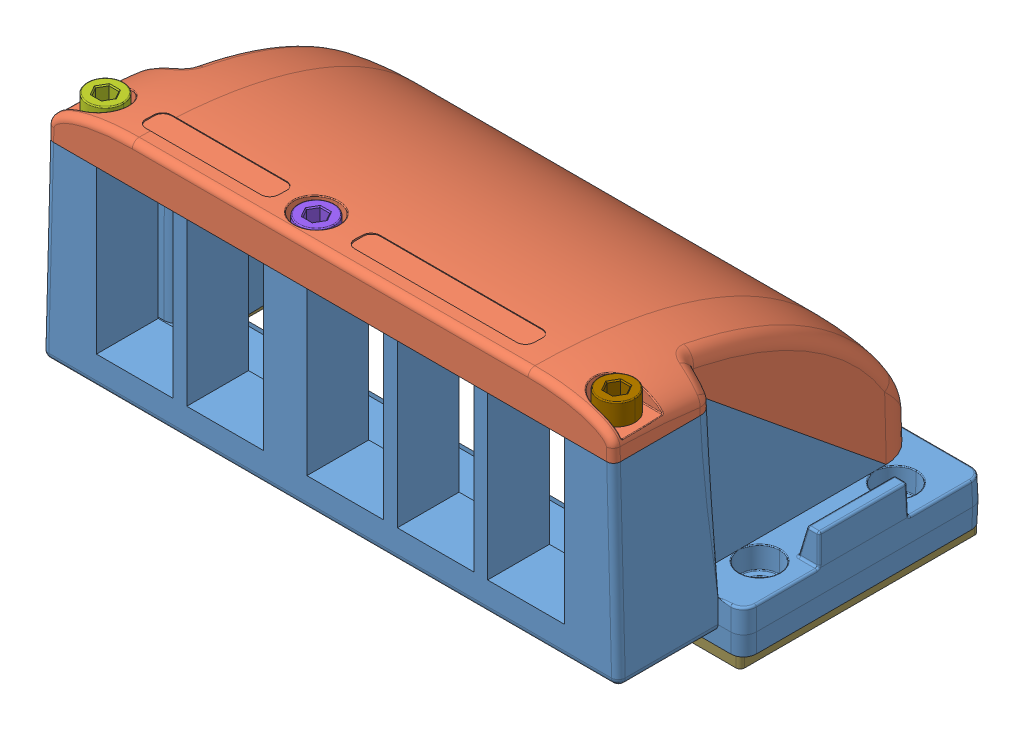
SolidWorks assembly 42340.SLDASM, configuration Default (file format 8000). Lengths in mm.
Overall size (147.28 60.12 80.15).
12 component instances, 12 part files, 0 mates.
Components (placement in the parent):
- 42340_01-1: 42340_01.SLDPRT [Default] at origin size (147.28 50 80.14)
- 42340_02-1: 42340_02.SLDPRT [Default] at origin size (135.03 48.33 79.2)
- 42340_03-1: 42340_03.SLDPRT [Default] at origin size (7.2 8.5 7.2)
- 42340_04-1: 42340_04.SLDPRT [Default] at origin size (7.2 8.5 7.2)
- 42340_05-1: 42340_05.SLDPRT [Default] at origin size (7.2 8.5 7.2)
- 42340_06-1: 42340_06.SLDPRT [Default] at origin size (7.2 8.5 7.2)
- 42340_07-1: 42340_07.SLDPRT [Default] at origin size (8.5 17 8.5)
- 42340_08-1: 42340_08.SLDPRT [Default] at origin size (8.5 17 8.5)
- 42340_09-1: 42340_09.SLDPRT [Default] at origin size (8.5 17 8.5)
- 42340_10-1: 42340_10.SLDPRT [Default] at origin size (8.5 17 8.5)
- 42340_11-1: 42340_11.SLDPRT [Default] at origin size (8.5 17 8.5)
- 42340_12-1: 42340_12.SLDPRT [Default] at origin size (145 2.5 56)
